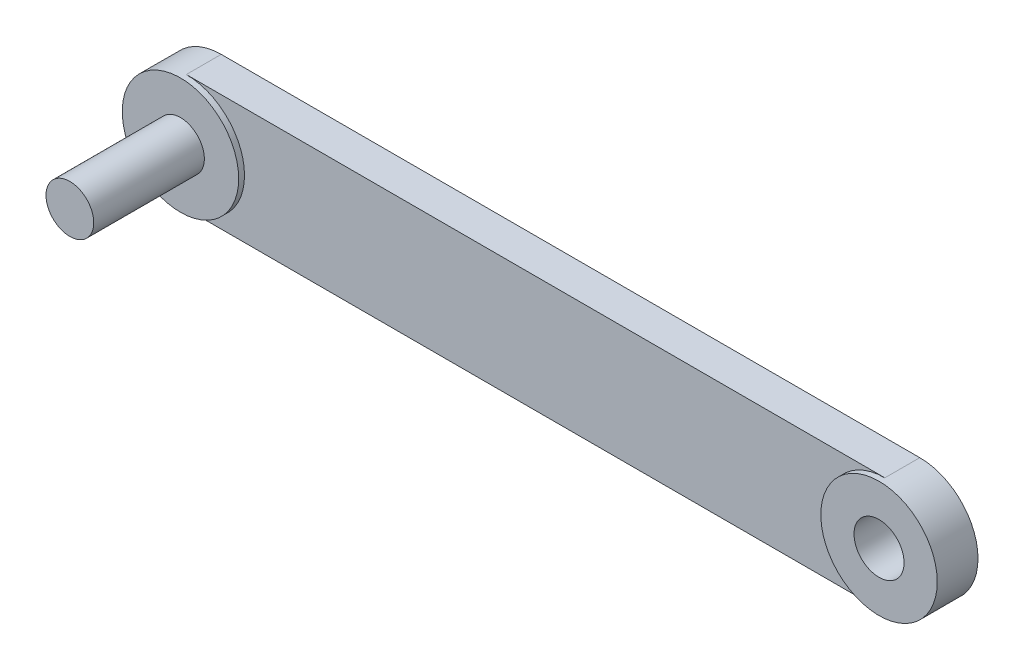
ISO-10303-21;
HEADER;
FILE_DESCRIPTION(('STEP AP214'),'2;1');
FILE_NAME('part.step','',(''),(''),'','','');
FILE_SCHEMA(('AUTOMOTIVE_DESIGN { 1 0 10303 214 1 1 1 1 }'));
ENDSEC;
DATA;
#1=APPLICATION_CONTEXT('core data for automotive mechanical design processes');
#2=APPLICATION_PROTOCOL_DEFINITION('international standard','automotive_design',2000,#1);
#3=PRODUCT_CONTEXT('',#1,'mechanical');
#4=PRODUCT('Part','Part','',(#3));
#5=PRODUCT_RELATED_PRODUCT_CATEGORY('part','',(#4));
#6=PRODUCT_DEFINITION_FORMATION('','',#4);
#7=PRODUCT_DEFINITION_CONTEXT('part definition',#1,'design');
#8=PRODUCT_DEFINITION('design','',#6,#7);
#9=PRODUCT_DEFINITION_SHAPE('','',#8);
#10=(LENGTH_UNIT() NAMED_UNIT(*) SI_UNIT(.MILLI.,.METRE.));
#11=(NAMED_UNIT(*) PLANE_ANGLE_UNIT() SI_UNIT($,.RADIAN.));
#12=(NAMED_UNIT(*) SI_UNIT($,.STERADIAN.) SOLID_ANGLE_UNIT());
#13=UNCERTAINTY_MEASURE_WITH_UNIT(LENGTH_MEASURE(1.E-05),#10,'distance_accuracy_value','');
#14=(GEOMETRIC_REPRESENTATION_CONTEXT(3) GLOBAL_UNCERTAINTY_ASSIGNED_CONTEXT((#13)) GLOBAL_UNIT_ASSIGNED_CONTEXT((#10,
#11,#12)) REPRESENTATION_CONTEXT('',''));
#15=CARTESIAN_POINT('',(0.,0.,0.));
#16=DIRECTION('',(0.,0.,1.));
#17=DIRECTION('',(1.,0.,0.));
#18=AXIS2_PLACEMENT_3D('',#15,#16,#17);
#19=CARTESIAN_POINT('',(0.,0.,3.));
#20=DIRECTION('',(0.,0.,1.));
#21=DIRECTION('',(1.,0.,0.));
#22=AXIS2_PLACEMENT_3D('',#19,#20,#21);
#23=PLANE('',#22);
#24=DIRECTION('',(1.,0.,0.));
#25=VECTOR('',#24,1.);
#26=CARTESIAN_POINT('',(0.,-5.,3.));
#27=LINE('',#26,#25);
#28=CARTESIAN_POINT('',(0.,-5.,3.));
#29=VERTEX_POINT('',#28);
#30=CARTESIAN_POINT('',(60.,-5.,3.));
#31=VERTEX_POINT('',#30);
#32=EDGE_CURVE('E53',#29,#31,#27,.T.);
#33=ORIENTED_EDGE('',*,*,#32,.T.);
#34=CARTESIAN_POINT('',(60.,0.,3.));
#35=DIRECTION('',(0.,0.,1.));
#36=DIRECTION('',(1.,0.,0.));
#37=AXIS2_PLACEMENT_3D('',#34,#35,#36);
#38=CIRCLE('',#37,5.);
#39=CARTESIAN_POINT('',(60.,5.,3.));
#40=VERTEX_POINT('',#39);
#41=EDGE_CURVE('E118',#40,#31,#38,.T.);
#42=ORIENTED_EDGE('',*,*,#41,.F.);
#43=DIRECTION('',(-1.,0.,0.));
#44=VECTOR('',#43,1.);
#45=CARTESIAN_POINT('',(0.,5.,3.));
#46=LINE('',#45,#44);
#47=CARTESIAN_POINT('',(0.,5.,3.));
#48=VERTEX_POINT('',#47);
#49=EDGE_CURVE('E91',#40,#48,#46,.T.);
#50=ORIENTED_EDGE('',*,*,#49,.T.);
#51=CARTESIAN_POINT('',(0.,0.,3.));
#52=DIRECTION('',(0.,0.,1.));
#53=DIRECTION('',(1.,0.,0.));
#54=AXIS2_PLACEMENT_3D('',#51,#52,#53);
#55=CIRCLE('',#54,5.);
#56=EDGE_CURVE('E11',#29,#48,#55,.T.);
#57=ORIENTED_EDGE('',*,*,#56,.F.);
#58=EDGE_LOOP('',(#33,#42,#50,#57));
#59=FACE_BOUND('',#58,.T.);
#60=ADVANCED_FACE('F35',(#59),#23,.T.);
#61=CARTESIAN_POINT('',(0.,0.,0.));
#62=DIRECTION('',(0.,0.,1.));
#63=DIRECTION('',(1.,0.,0.));
#64=AXIS2_PLACEMENT_3D('',#61,#62,#63);
#65=PLANE('',#64);
#66=CARTESIAN_POINT('',(0.,0.,0.));
#67=DIRECTION('',(0.,0.,1.));
#68=DIRECTION('',(1.,0.,0.));
#69=AXIS2_PLACEMENT_3D('',#66,#67,#68);
#70=CIRCLE('',#69,5.);
#71=CARTESIAN_POINT('',(0.,5.,0.));
#72=VERTEX_POINT('',#71);
#73=CARTESIAN_POINT('',(0.,-5.,0.));
#74=VERTEX_POINT('',#73);
#75=EDGE_CURVE('E90',#72,#74,#70,.T.);
#76=ORIENTED_EDGE('',*,*,#75,.F.);
#77=DIRECTION('',(-1.,0.,0.));
#78=VECTOR('',#77,1.);
#79=CARTESIAN_POINT('',(0.,5.,0.));
#80=LINE('',#79,#78);
#81=CARTESIAN_POINT('',(60.,5.,0.));
#82=VERTEX_POINT('',#81);
#83=EDGE_CURVE('E76',#82,#72,#80,.T.);
#84=ORIENTED_EDGE('',*,*,#83,.F.);
#85=CARTESIAN_POINT('',(60.,0.,0.));
#86=DIRECTION('',(0.,0.,1.));
#87=DIRECTION('',(1.,0.,0.));
#88=AXIS2_PLACEMENT_3D('',#85,#86,#87);
#89=CIRCLE('',#88,5.);
#90=CARTESIAN_POINT('',(60.,-5.,0.));
#91=VERTEX_POINT('',#90);
#92=EDGE_CURVE('E70',#91,#82,#89,.T.);
#93=ORIENTED_EDGE('',*,*,#92,.F.);
#94=DIRECTION('',(1.,0.,0.));
#95=VECTOR('',#94,1.);
#96=CARTESIAN_POINT('',(0.,-5.,0.));
#97=LINE('',#96,#95);
#98=EDGE_CURVE('E95',#74,#91,#97,.T.);
#99=ORIENTED_EDGE('',*,*,#98,.F.);
#100=EDGE_LOOP('',(#76,#84,#93,#99));
#101=FACE_BOUND('',#100,.T.);
#102=CARTESIAN_POINT('',(60.,0.,0.));
#103=DIRECTION('',(0.,0.,1.));
#104=DIRECTION('',(1.,0.,0.));
#105=AXIS2_PLACEMENT_3D('',#102,#103,#104);
#106=CIRCLE('',#105,2.15);
#107=CARTESIAN_POINT('',(62.15,0.,0.));
#108=VERTEX_POINT('',#107);
#109=EDGE_CURVE('E97',#108,#108,#106,.T.);
#110=ORIENTED_EDGE('',*,*,#109,.T.);
#111=EDGE_LOOP('',(#110));
#112=FACE_BOUND('',#111,.T.);
#113=ADVANCED_FACE('F93',(#101,#112),#65,.F.);
#114=CARTESIAN_POINT('',(0.,0.,3.));
#115=DIRECTION('',(0.,0.,-1.));
#116=DIRECTION('',(-1.,0.,0.));
#117=AXIS2_PLACEMENT_3D('',#114,#115,#116);
#118=CYLINDRICAL_SURFACE('',#117,5.);
#119=ORIENTED_EDGE('',*,*,#75,.T.);
#120=DIRECTION('',(0.,0.,-1.));
#121=VECTOR('',#120,1.);
#122=CARTESIAN_POINT('',(0.,-5.,3.));
#123=LINE('',#122,#121);
#124=EDGE_CURVE('E39',#29,#74,#123,.T.);
#125=ORIENTED_EDGE('',*,*,#124,.F.);
#126=ORIENTED_EDGE('',*,*,#56,.T.);
#127=DIRECTION('',(0.,0.,-1.));
#128=VECTOR('',#127,1.);
#129=CARTESIAN_POINT('',(0.,5.,3.));
#130=LINE('',#129,#128);
#131=EDGE_CURVE('E80',#48,#72,#130,.T.);
#132=ORIENTED_EDGE('',*,*,#131,.T.);
#133=EDGE_LOOP('',(#119,#125,#126,#132));
#134=FACE_BOUND('',#133,.T.);
#135=CARTESIAN_POINT('',(0.,0.,3.5));
#136=DIRECTION('',(0.,0.,1.));
#137=DIRECTION('',(1.,0.,0.));
#138=AXIS2_PLACEMENT_3D('',#135,#136,#137);
#139=CIRCLE('',#138,5.);
#140=CARTESIAN_POINT('',(5.,0.,3.5));
#141=VERTEX_POINT('',#140);
#142=EDGE_CURVE('E101',#141,#141,#139,.T.);
#143=ORIENTED_EDGE('',*,*,#142,.F.);
#144=EDGE_LOOP('',(#143));
#145=FACE_BOUND('',#144,.T.);
#146=ADVANCED_FACE('F37',(#134,#145),#118,.T.);
#147=CARTESIAN_POINT('',(0.,-5.,3.));
#148=DIRECTION('',(0.,1.,0.));
#149=DIRECTION('',(0.,0.,1.));
#150=AXIS2_PLACEMENT_3D('',#147,#148,#149);
#151=PLANE('',#150);
#152=ORIENTED_EDGE('',*,*,#98,.T.);
#153=DIRECTION('',(0.,0.,-1.));
#154=VECTOR('',#153,1.);
#155=CARTESIAN_POINT('',(60.,-5.,3.));
#156=LINE('',#155,#154);
#157=EDGE_CURVE('E107',#31,#91,#156,.T.);
#158=ORIENTED_EDGE('',*,*,#157,.F.);
#159=ORIENTED_EDGE('',*,*,#32,.F.);
#160=ORIENTED_EDGE('',*,*,#124,.T.);
#161=EDGE_LOOP('',(#152,#158,#159,#160));
#162=FACE_BOUND('',#161,.T.);
#163=ADVANCED_FACE('F110',(#162),#151,.F.);
#164=CARTESIAN_POINT('',(60.,0.,3.));
#165=DIRECTION('',(0.,0.,-1.));
#166=DIRECTION('',(-1.,0.,0.));
#167=AXIS2_PLACEMENT_3D('',#164,#165,#166);
#168=CYLINDRICAL_SURFACE('',#167,5.);
#169=ORIENTED_EDGE('',*,*,#92,.T.);
#170=DIRECTION('',(0.,0.,-1.));
#171=VECTOR('',#170,1.);
#172=CARTESIAN_POINT('',(60.,5.,3.));
#173=LINE('',#172,#171);
#174=EDGE_CURVE('E82',#40,#82,#173,.T.);
#175=ORIENTED_EDGE('',*,*,#174,.F.);
#176=ORIENTED_EDGE('',*,*,#41,.T.);
#177=ORIENTED_EDGE('',*,*,#157,.T.);
#178=EDGE_LOOP('',(#169,#175,#176,#177));
#179=FACE_BOUND('',#178,.T.);
#180=CARTESIAN_POINT('',(60.,0.,3.5));
#181=DIRECTION('',(0.,0.,1.));
#182=DIRECTION('',(1.,0.,0.));
#183=AXIS2_PLACEMENT_3D('',#180,#181,#182);
#184=CIRCLE('',#183,5.);
#185=CARTESIAN_POINT('',(65.,0.,3.5));
#186=VERTEX_POINT('',#185);
#187=EDGE_CURVE('E117',#186,#186,#184,.T.);
#188=ORIENTED_EDGE('',*,*,#187,.F.);
#189=EDGE_LOOP('',(#188));
#190=FACE_BOUND('',#189,.T.);
#191=ADVANCED_FACE('F156',(#179,#190),#168,.T.);
#192=CARTESIAN_POINT('',(0.,5.,3.));
#193=DIRECTION('',(0.,-1.,0.));
#194=DIRECTION('',(0.,0.,-1.));
#195=AXIS2_PLACEMENT_3D('',#192,#193,#194);
#196=PLANE('',#195);
#197=ORIENTED_EDGE('',*,*,#83,.T.);
#198=ORIENTED_EDGE('',*,*,#131,.F.);
#199=ORIENTED_EDGE('',*,*,#49,.F.);
#200=ORIENTED_EDGE('',*,*,#174,.T.);
#201=EDGE_LOOP('',(#197,#198,#199,#200));
#202=FACE_BOUND('',#201,.T.);
#203=ADVANCED_FACE('F78',(#202),#196,.F.);
#204=CARTESIAN_POINT('',(60.,0.,3.));
#205=DIRECTION('',(0.,0.,-1.));
#206=DIRECTION('',(-1.,0.,0.));
#207=AXIS2_PLACEMENT_3D('',#204,#205,#206);
#208=CYLINDRICAL_SURFACE('',#207,2.15);
#209=ORIENTED_EDGE('',*,*,#109,.F.);
#210=EDGE_LOOP('',(#209));
#211=FACE_BOUND('',#210,.T.);
#212=CARTESIAN_POINT('',(60.,0.,3.5));
#213=DIRECTION('',(0.,0.,1.));
#214=DIRECTION('',(1.,0.,0.));
#215=AXIS2_PLACEMENT_3D('',#212,#213,#214);
#216=CIRCLE('',#215,2.15);
#217=CARTESIAN_POINT('',(62.15,0.,3.5));
#218=VERTEX_POINT('',#217);
#219=EDGE_CURVE('E120',#218,#218,#216,.T.);
#220=ORIENTED_EDGE('',*,*,#219,.T.);
#221=EDGE_LOOP('',(#220));
#222=FACE_BOUND('',#221,.T.);
#223=ADVANCED_FACE('F151',(#211,#222),#208,.F.);
#224=CARTESIAN_POINT('',(0.,0.,3.5));
#225=DIRECTION('',(0.,0.,1.));
#226=DIRECTION('',(1.,0.,0.));
#227=AXIS2_PLACEMENT_3D('',#224,#225,#226);
#228=PLANE('',#227);
#229=ORIENTED_EDGE('',*,*,#142,.T.);
#230=EDGE_LOOP('',(#229));
#231=FACE_BOUND('',#230,.T.);
#232=CARTESIAN_POINT('',(0.,0.,3.5));
#233=DIRECTION('',(0.,0.,1.));
#234=DIRECTION('',(1.,0.,0.));
#235=AXIS2_PLACEMENT_3D('',#232,#233,#234);
#236=CIRCLE('',#235,2.05);
#237=CARTESIAN_POINT('',(-2.05,0.,3.5));
#238=VERTEX_POINT('',#237);
#239=EDGE_CURVE('E114',#238,#238,#236,.T.);
#240=ORIENTED_EDGE('',*,*,#239,.F.);
#241=EDGE_LOOP('',(#240));
#242=FACE_BOUND('',#241,.T.);
#243=ADVANCED_FACE('F141',(#231,#242),#228,.T.);
#244=CARTESIAN_POINT('',(60.,0.,3.5));
#245=DIRECTION('',(0.,0.,1.));
#246=DIRECTION('',(1.,0.,0.));
#247=AXIS2_PLACEMENT_3D('',#244,#245,#246);
#248=PLANE('',#247);
#249=ORIENTED_EDGE('',*,*,#187,.T.);
#250=EDGE_LOOP('',(#249));
#251=FACE_BOUND('',#250,.T.);
#252=ORIENTED_EDGE('',*,*,#219,.F.);
#253=EDGE_LOOP('',(#252));
#254=FACE_BOUND('',#253,.T.);
#255=ADVANCED_FACE('F133',(#251,#254),#248,.T.);
#256=CARTESIAN_POINT('',(0.,0.,13.));
#257=DIRECTION('',(0.,0.,-1.));
#258=DIRECTION('',(-1.,0.,0.));
#259=AXIS2_PLACEMENT_3D('',#256,#257,#258);
#260=PLANE('',#259);
#261=CARTESIAN_POINT('',(0.,0.,13.));
#262=DIRECTION('',(0.,0.,-1.));
#263=DIRECTION('',(-1.,0.,0.));
#264=AXIS2_PLACEMENT_3D('',#261,#262,#263);
#265=CIRCLE('',#264,2.05);
#266=CARTESIAN_POINT('',(-2.05,0.,13.));
#267=VERTEX_POINT('',#266);
#268=EDGE_CURVE('E125',#267,#267,#265,.T.);
#269=ORIENTED_EDGE('',*,*,#268,.F.);
#270=EDGE_LOOP('',(#269));
#271=FACE_BOUND('',#270,.T.);
#272=ADVANCED_FACE('F131',(#271),#260,.F.);
#273=CARTESIAN_POINT('',(0.,0.,13.));
#274=DIRECTION('',(0.,0.,-1.));
#275=DIRECTION('',(-1.,0.,0.));
#276=AXIS2_PLACEMENT_3D('',#273,#274,#275);
#277=CYLINDRICAL_SURFACE('',#276,2.05);
#278=CARTESIAN_POINT('',(-2.05,0.,3.5));
#279=CARTESIAN_POINT('',(-2.05,0.,3.59895833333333));
#280=CARTESIAN_POINT('',(-2.05,0.,3.69791666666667));
#281=CARTESIAN_POINT('',(-2.05,0.,3.89583333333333));
#282=CARTESIAN_POINT('',(-2.05,0.,3.99479166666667));
#283=CARTESIAN_POINT('',(-2.05,0.,4.19270833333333));
#284=CARTESIAN_POINT('',(-2.05,0.,4.29166666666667));
#285=CARTESIAN_POINT('',(-2.05,0.,4.48958333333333));
#286=CARTESIAN_POINT('',(-2.05,0.,4.58854166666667));
#287=CARTESIAN_POINT('',(-2.05,0.,4.78645833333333));
#288=CARTESIAN_POINT('',(-2.05,0.,4.88541666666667));
#289=CARTESIAN_POINT('',(-2.05,0.,5.08333333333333));
#290=CARTESIAN_POINT('',(-2.05,0.,5.18229166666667));
#291=CARTESIAN_POINT('',(-2.05,0.,5.38020833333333));
#292=CARTESIAN_POINT('',(-2.05,0.,5.47916666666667));
#293=CARTESIAN_POINT('',(-2.05,0.,5.67708333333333));
#294=CARTESIAN_POINT('',(-2.05,0.,5.77604166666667));
#295=CARTESIAN_POINT('',(-2.05,0.,5.97395833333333));
#296=CARTESIAN_POINT('',(-2.05,0.,6.07291666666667));
#297=CARTESIAN_POINT('',(-2.05,0.,6.27083333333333));
#298=CARTESIAN_POINT('',(-2.05,0.,6.36979166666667));
#299=CARTESIAN_POINT('',(-2.05,0.,6.56770833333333));
#300=CARTESIAN_POINT('',(-2.05,0.,6.66666666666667));
#301=CARTESIAN_POINT('',(-2.05,0.,6.86458333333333));
#302=CARTESIAN_POINT('',(-2.05,0.,6.96354166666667));
#303=CARTESIAN_POINT('',(-2.05,0.,7.16145833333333));
#304=CARTESIAN_POINT('',(-2.05,0.,7.26041666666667));
#305=CARTESIAN_POINT('',(-2.05,0.,7.45833333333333));
#306=CARTESIAN_POINT('',(-2.05,0.,7.55729166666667));
#307=CARTESIAN_POINT('',(-2.05,0.,7.75520833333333));
#308=CARTESIAN_POINT('',(-2.05,0.,7.85416666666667));
#309=CARTESIAN_POINT('',(-2.05,0.,8.05208333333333));
#310=CARTESIAN_POINT('',(-2.05,0.,8.15104166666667));
#311=CARTESIAN_POINT('',(-2.05,0.,8.34895833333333));
#312=CARTESIAN_POINT('',(-2.05,0.,8.44791666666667));
#313=CARTESIAN_POINT('',(-2.05,0.,8.64583333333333));
#314=CARTESIAN_POINT('',(-2.05,0.,8.74479166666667));
#315=CARTESIAN_POINT('',(-2.05,0.,8.94270833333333));
#316=CARTESIAN_POINT('',(-2.05,0.,9.04166666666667));
#317=CARTESIAN_POINT('',(-2.05,0.,9.23958333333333));
#318=CARTESIAN_POINT('',(-2.05,0.,9.33854166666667));
#319=CARTESIAN_POINT('',(-2.05,0.,9.53645833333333));
#320=CARTESIAN_POINT('',(-2.05,0.,9.63541666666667));
#321=CARTESIAN_POINT('',(-2.05,0.,9.83333333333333));
#322=CARTESIAN_POINT('',(-2.05,0.,9.93229166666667));
#323=CARTESIAN_POINT('',(-2.05,0.,10.1302083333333));
#324=CARTESIAN_POINT('',(-2.05,0.,10.2291666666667));
#325=CARTESIAN_POINT('',(-2.05,0.,10.4270833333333));
#326=CARTESIAN_POINT('',(-2.05,0.,10.5260416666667));
#327=CARTESIAN_POINT('',(-2.05,0.,10.7239583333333));
#328=CARTESIAN_POINT('',(-2.05,0.,10.8229166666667));
#329=CARTESIAN_POINT('',(-2.05,0.,11.0208333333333));
#330=CARTESIAN_POINT('',(-2.05,0.,11.1197916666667));
#331=CARTESIAN_POINT('',(-2.05,0.,11.3177083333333));
#332=CARTESIAN_POINT('',(-2.05,0.,11.4166666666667));
#333=CARTESIAN_POINT('',(-2.05,0.,11.6145833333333));
#334=CARTESIAN_POINT('',(-2.05,0.,11.7135416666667));
#335=CARTESIAN_POINT('',(-2.05,0.,11.9114583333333));
#336=CARTESIAN_POINT('',(-2.05,0.,12.0104166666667));
#337=CARTESIAN_POINT('',(-2.05,0.,12.2083333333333));
#338=CARTESIAN_POINT('',(-2.05,0.,12.3072916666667));
#339=CARTESIAN_POINT('',(-2.05,0.,12.5052083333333));
#340=CARTESIAN_POINT('',(-2.05,0.,12.6041666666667));
#341=CARTESIAN_POINT('',(-2.05,0.,12.8020833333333));
#342=CARTESIAN_POINT('',(-2.05,0.,12.9010416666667));
#343=CARTESIAN_POINT('',(-2.05,0.,13.));
#344=B_SPLINE_CURVE_WITH_KNOTS('',3,(#278,#279,#280,#281,#282,#283,#284,#285,#286,#287,#288,
#289,#290,#291,#292,#293,#294,#295,#296,#297,#298,#299,#300,#301,#302,#303,#304,#305,#306,#307,
#308,#309,#310,#311,#312,#313,#314,#315,#316,#317,#318,#319,#320,#321,#322,#323,#324,#325,#326,
#327,#328,#329,#330,#331,#332,#333,#334,#335,#336,#337,#338,#339,#340,#341,#342,#343),
.UNSPECIFIED.,.F.,.F.,(4,2,2,2,2,2,2,2,2,2,2,2,2,2,2,2,2,2,2,2,2,2,2,2,2,2,2,2,2,2,2,2,4),(0.,
0.296875,0.593750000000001,0.890625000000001,1.1875,1.484375,1.78125,2.078125,2.375,2.671875,
2.96875,3.265625,3.5625,3.859375,4.15625,4.453125,4.75,5.046875,5.34375,5.640625,5.9375,
6.234375,6.53125,6.828125,7.125,7.421875,7.71875,8.015625,8.3125,8.609375,8.90625,9.203125,9.5),.UNSPECIFIED.);
#345=EDGE_CURVE('BSEAM129',#238,#267,#344,.T.);
#346=ORIENTED_EDGE('',*,*,#239,.T.);
#347=ORIENTED_EDGE('',*,*,#268,.T.);
#348=ORIENTED_EDGE('',*,*,#345,.T.);
#349=ORIENTED_EDGE('',*,*,#345,.F.);
#350=EDGE_LOOP('',(#346,#348,#347,#349));
#351=FACE_BOUND('',#350,.T.);
#352=ADVANCED_FACE('F129',(#351),#277,.T.);
#353=CLOSED_SHELL('',(#60,#113,#146,#163,#191,#203,#223,#243,#255,#272,#352));
#354=MANIFOLD_SOLID_BREP('B2',#353);
#355=ADVANCED_BREP_SHAPE_REPRESENTATION('',(#18,#354),#14);
#356=SHAPE_DEFINITION_REPRESENTATION(#9,#355);
ENDSEC;
END-ISO-10303-21;
